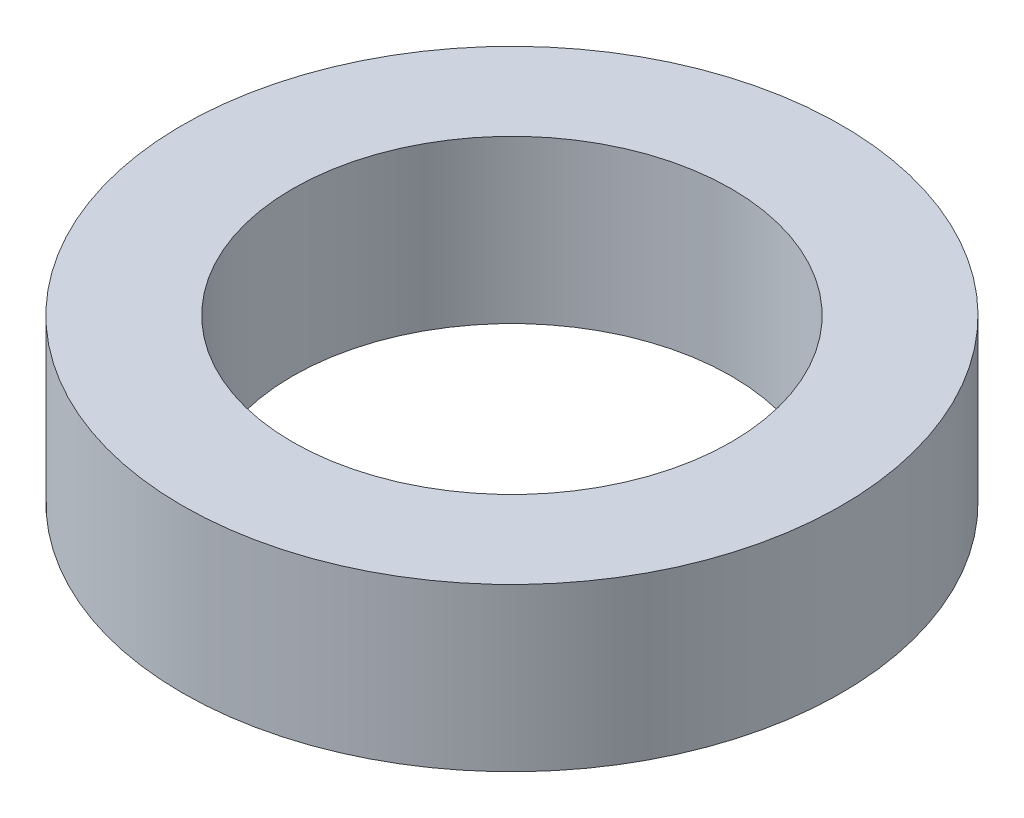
from build123d import *

# Parameters (mm, degrees)
SKETCH2_R             = 2.032
BOSS_EXTRUDE1_DEPTH   = 1
F_2_CLEARANCE_HOLE1_D = 2.7051


with BuildPart() as part:
    # Sketch2 → Boss-Extrude1 (new body)
    with BuildSketch(Plane(origin=(0, 0, 0), x_dir=(1, 0, 0), z_dir=(0, 1, 0))):
        with Locations(Location((0, 0, 0), (0, 0, 270))):
            Circle(SKETCH2_R)
    extrude(amount=BOSS_EXTRUDE1_DEPTH)

    # 2 Clearance Hole1 (through all)
    with Locations(Plane(origin=(0, 1, 0), x_dir=(1, 0, 0), z_dir=(0, 1, 0))):
        with Locations((0, 0)):
            Hole(F_2_CLEARANCE_HOLE1_D / 2)


solid = part.part
